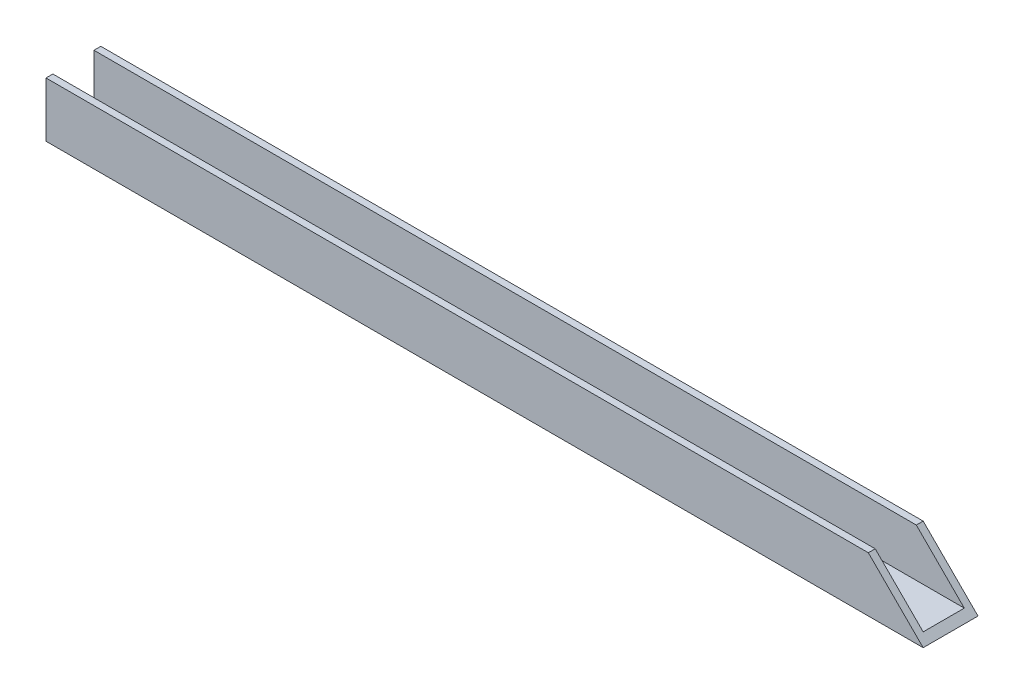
ISO-10303-21;
HEADER;
FILE_DESCRIPTION(('STEP AP214'),'2;1');
FILE_NAME('part.step','',(''),(''),'','','');
FILE_SCHEMA(('AUTOMOTIVE_DESIGN { 1 0 10303 214 1 1 1 1 }'));
ENDSEC;
DATA;
#1=APPLICATION_CONTEXT('core data for automotive mechanical design processes');
#2=APPLICATION_PROTOCOL_DEFINITION('international standard','automotive_design',2000,#1);
#3=PRODUCT_CONTEXT('',#1,'mechanical');
#4=PRODUCT('Part','Part','',(#3));
#5=PRODUCT_RELATED_PRODUCT_CATEGORY('part','',(#4));
#6=PRODUCT_DEFINITION_FORMATION('','',#4);
#7=PRODUCT_DEFINITION_CONTEXT('part definition',#1,'design');
#8=PRODUCT_DEFINITION('design','',#6,#7);
#9=PRODUCT_DEFINITION_SHAPE('','',#8);
#10=(LENGTH_UNIT() NAMED_UNIT(*) SI_UNIT(.MILLI.,.METRE.));
#11=(NAMED_UNIT(*) PLANE_ANGLE_UNIT() SI_UNIT($,.RADIAN.));
#12=(NAMED_UNIT(*) SI_UNIT($,.STERADIAN.) SOLID_ANGLE_UNIT());
#13=UNCERTAINTY_MEASURE_WITH_UNIT(LENGTH_MEASURE(1.E-05),#10,'distance_accuracy_value','');
#14=(GEOMETRIC_REPRESENTATION_CONTEXT(3) GLOBAL_UNCERTAINTY_ASSIGNED_CONTEXT((#13)) GLOBAL_UNIT_ASSIGNED_CONTEXT((#10,
#11,#12)) REPRESENTATION_CONTEXT('',''));
#15=CARTESIAN_POINT('',(0.,0.,0.));
#16=DIRECTION('',(0.,0.,1.));
#17=DIRECTION('',(1.,0.,0.));
#18=AXIS2_PLACEMENT_3D('',#15,#16,#17);
#19=CARTESIAN_POINT('',(406.4,22.225,9.525));
#20=DIRECTION('',(0.,0.,1.));
#21=DIRECTION('',(0.,-1.,0.));
#22=AXIS2_PLACEMENT_3D('',#19,#20,#21);
#23=PLANE('',#22);
#24=DIRECTION('',(-0.707106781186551,0.707106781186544,0.));
#25=VECTOR('',#24,1.);
#26=CARTESIAN_POINT('',(393.7,9.52499999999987,9.525));
#27=LINE('',#26,#25);
#28=CARTESIAN_POINT('',(403.225,0.,9.525));
#29=VERTEX_POINT('',#28);
#30=CARTESIAN_POINT('',(381.,22.225,9.52500000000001));
#31=VERTEX_POINT('',#30);
#32=EDGE_CURVE('E170',#29,#31,#27,.T.);
#33=ORIENTED_EDGE('',*,*,#32,.F.);
#34=DIRECTION('',(-1.,0.,0.));
#35=VECTOR('',#34,1.);
#36=CARTESIAN_POINT('',(406.4,0.,9.525));
#37=LINE('',#36,#35);
#38=CARTESIAN_POINT('',(0.,0.,9.525));
#39=VERTEX_POINT('',#38);
#40=EDGE_CURVE('E91',#29,#39,#37,.T.);
#41=ORIENTED_EDGE('',*,*,#40,.T.);
#42=DIRECTION('',(0.,1.,0.));
#43=VECTOR('',#42,1.);
#44=CARTESIAN_POINT('',(0.,22.225,9.525));
#45=LINE('',#44,#43);
#46=CARTESIAN_POINT('',(0.,22.225,9.525));
#47=VERTEX_POINT('',#46);
#48=EDGE_CURVE('E105',#39,#47,#45,.T.);
#49=ORIENTED_EDGE('',*,*,#48,.T.);
#50=DIRECTION('',(-1.,0.,0.));
#51=VECTOR('',#50,1.);
#52=CARTESIAN_POINT('',(406.4,22.225,9.525));
#53=LINE('',#52,#51);
#54=EDGE_CURVE('E13',#31,#47,#53,.T.);
#55=ORIENTED_EDGE('',*,*,#54,.F.);
#56=EDGE_LOOP('',(#33,#41,#49,#55));
#57=FACE_BOUND('',#56,.T.);
#58=ADVANCED_FACE('F34',(#57),#23,.F.);
#59=CARTESIAN_POINT('',(406.4,22.225,12.7));
#60=DIRECTION('',(0.,-1.,0.));
#61=DIRECTION('',(0.,0.,-1.));
#62=AXIS2_PLACEMENT_3D('',#59,#60,#61);
#63=PLANE('',#62);
#64=DIRECTION('',(0.,0.,1.));
#65=VECTOR('',#64,1.);
#66=CARTESIAN_POINT('',(381.,22.225,-1226.77090352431));
#67=LINE('',#66,#65);
#68=CARTESIAN_POINT('',(381.,22.225,12.7));
#69=VERTEX_POINT('',#68);
#70=EDGE_CURVE('E177',#31,#69,#67,.T.);
#71=ORIENTED_EDGE('',*,*,#70,.F.);
#72=ORIENTED_EDGE('',*,*,#54,.T.);
#73=DIRECTION('',(0.,0.,1.));
#74=VECTOR('',#73,1.);
#75=CARTESIAN_POINT('',(0.,22.225,12.7));
#76=LINE('',#75,#74);
#77=CARTESIAN_POINT('',(0.,22.225,12.7));
#78=VERTEX_POINT('',#77);
#79=EDGE_CURVE('E129',#47,#78,#76,.T.);
#80=ORIENTED_EDGE('',*,*,#79,.T.);
#81=DIRECTION('',(-1.,0.,0.));
#82=VECTOR('',#81,1.);
#83=CARTESIAN_POINT('',(406.4,22.225,12.7));
#84=LINE('',#83,#82);
#85=EDGE_CURVE('E42',#69,#78,#84,.T.);
#86=ORIENTED_EDGE('',*,*,#85,.F.);
#87=EDGE_LOOP('',(#71,#72,#80,#86));
#88=FACE_BOUND('',#87,.T.);
#89=ADVANCED_FACE('F130',(#88),#63,.F.);
#90=CARTESIAN_POINT('',(406.4,-3.175,12.7));
#91=DIRECTION('',(0.,0.,-1.));
#92=DIRECTION('',(-1.,0.,0.));
#93=AXIS2_PLACEMENT_3D('',#90,#91,#92);
#94=PLANE('',#93);
#95=DIRECTION('',(-0.707106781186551,0.707106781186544,0.));
#96=VECTOR('',#95,1.);
#97=CARTESIAN_POINT('',(406.4,-3.175,12.7));
#98=LINE('',#97,#96);
#99=CARTESIAN_POINT('',(406.4,-3.175,12.7));
#100=VERTEX_POINT('',#99);
#101=EDGE_CURVE('E49',#100,#69,#98,.T.);
#102=ORIENTED_EDGE('',*,*,#101,.T.);
#103=ORIENTED_EDGE('',*,*,#85,.T.);
#104=DIRECTION('',(0.,-1.,0.));
#105=VECTOR('',#104,1.);
#106=CARTESIAN_POINT('',(0.,-3.175,12.7));
#107=LINE('',#106,#105);
#108=CARTESIAN_POINT('',(0.,-3.175,12.7));
#109=VERTEX_POINT('',#108);
#110=EDGE_CURVE('E125',#78,#109,#107,.T.);
#111=ORIENTED_EDGE('',*,*,#110,.T.);
#112=DIRECTION('',(-1.,0.,0.));
#113=VECTOR('',#112,1.);
#114=CARTESIAN_POINT('',(406.4,-3.175,12.7));
#115=LINE('',#114,#113);
#116=EDGE_CURVE('E118',#100,#109,#115,.T.);
#117=ORIENTED_EDGE('',*,*,#116,.F.);
#118=EDGE_LOOP('',(#102,#103,#111,#117));
#119=FACE_BOUND('',#118,.T.);
#120=ADVANCED_FACE('F123',(#119),#94,.F.);
#121=CARTESIAN_POINT('',(406.4,22.225,-12.7));
#122=DIRECTION('',(0.,0.,1.));
#123=DIRECTION('',(1.,0.,0.));
#124=AXIS2_PLACEMENT_3D('',#121,#122,#123);
#125=PLANE('',#124);
#126=DIRECTION('',(-0.707106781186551,0.707106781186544,0.));
#127=VECTOR('',#126,1.);
#128=CARTESIAN_POINT('',(393.7,9.52499999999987,-12.7));
#129=LINE('',#128,#127);
#130=CARTESIAN_POINT('',(406.4,-3.175,-12.6999999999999));
#131=VERTEX_POINT('',#130);
#132=CARTESIAN_POINT('',(381.,22.225,-12.6999999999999));
#133=VERTEX_POINT('',#132);
#134=EDGE_CURVE('E154',#131,#133,#129,.T.);
#135=ORIENTED_EDGE('',*,*,#134,.F.);
#136=DIRECTION('',(-1.,0.,0.));
#137=VECTOR('',#136,1.);
#138=CARTESIAN_POINT('',(406.4,-3.175,-12.7));
#139=LINE('',#138,#137);
#140=CARTESIAN_POINT('',(0.,-3.175,-12.7));
#141=VERTEX_POINT('',#140);
#142=EDGE_CURVE('E115',#131,#141,#139,.T.);
#143=ORIENTED_EDGE('',*,*,#142,.T.);
#144=DIRECTION('',(0.,1.,0.));
#145=VECTOR('',#144,1.);
#146=CARTESIAN_POINT('',(0.,22.225,-12.7));
#147=LINE('',#146,#145);
#148=CARTESIAN_POINT('',(0.,22.225,-12.7));
#149=VERTEX_POINT('',#148);
#150=EDGE_CURVE('E137',#141,#149,#147,.T.);
#151=ORIENTED_EDGE('',*,*,#150,.T.);
#152=DIRECTION('',(-1.,0.,0.));
#153=VECTOR('',#152,1.);
#154=CARTESIAN_POINT('',(406.4,22.225,-12.7));
#155=LINE('',#154,#153);
#156=EDGE_CURVE('E113',#133,#149,#155,.T.);
#157=ORIENTED_EDGE('',*,*,#156,.F.);
#158=EDGE_LOOP('',(#135,#143,#151,#157));
#159=FACE_BOUND('',#158,.T.);
#160=ADVANCED_FACE('F149',(#159),#125,.F.);
#161=CARTESIAN_POINT('',(406.4,22.225,-9.52499999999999));
#162=DIRECTION('',(0.,-1.,0.));
#163=DIRECTION('',(0.,0.,-1.));
#164=AXIS2_PLACEMENT_3D('',#161,#162,#163);
#165=PLANE('',#164);
#166=CARTESIAN_POINT('',(381.,22.225,-9.52500000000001));
#167=VERTEX_POINT('',#166);
#168=EDGE_CURVE('E179',#133,#167,#67,.T.);
#169=ORIENTED_EDGE('',*,*,#168,.F.);
#170=ORIENTED_EDGE('',*,*,#156,.T.);
#171=DIRECTION('',(0.,0.,1.));
#172=VECTOR('',#171,1.);
#173=CARTESIAN_POINT('',(0.,22.225,-9.52499999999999));
#174=LINE('',#173,#172);
#175=CARTESIAN_POINT('',(0.,22.225,-9.52499999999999));
#176=VERTEX_POINT('',#175);
#177=EDGE_CURVE('E100',#149,#176,#174,.T.);
#178=ORIENTED_EDGE('',*,*,#177,.T.);
#179=DIRECTION('',(-1.,0.,0.));
#180=VECTOR('',#179,1.);
#181=CARTESIAN_POINT('',(406.4,22.225,-9.52499999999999));
#182=LINE('',#181,#180);
#183=EDGE_CURVE('E90',#167,#176,#182,.T.);
#184=ORIENTED_EDGE('',*,*,#183,.F.);
#185=EDGE_LOOP('',(#169,#170,#178,#184));
#186=FACE_BOUND('',#185,.T.);
#187=ADVANCED_FACE('F144',(#186),#165,.F.);
#188=CARTESIAN_POINT('',(406.4,0.,-9.525));
#189=DIRECTION('',(0.,0.,-1.));
#190=DIRECTION('',(0.,1.,0.));
#191=AXIS2_PLACEMENT_3D('',#188,#189,#190);
#192=PLANE('',#191);
#193=DIRECTION('',(0.707106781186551,-0.707106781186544,0.));
#194=VECTOR('',#193,1.);
#195=CARTESIAN_POINT('',(404.8125,-1.58750000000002,-9.525));
#196=LINE('',#195,#194);
#197=CARTESIAN_POINT('',(403.225,0.,-9.525));
#198=VERTEX_POINT('',#197);
#199=EDGE_CURVE('E167',#167,#198,#196,.T.);
#200=ORIENTED_EDGE('',*,*,#199,.F.);
#201=ORIENTED_EDGE('',*,*,#183,.T.);
#202=DIRECTION('',(0.,-1.,0.));
#203=VECTOR('',#202,1.);
#204=CARTESIAN_POINT('',(0.,0.,-9.525));
#205=LINE('',#204,#203);
#206=CARTESIAN_POINT('',(0.,0.,-9.525));
#207=VERTEX_POINT('',#206);
#208=EDGE_CURVE('E94',#176,#207,#205,.T.);
#209=ORIENTED_EDGE('',*,*,#208,.T.);
#210=DIRECTION('',(-1.,0.,0.));
#211=VECTOR('',#210,1.);
#212=CARTESIAN_POINT('',(406.4,0.,-9.525));
#213=LINE('',#212,#211);
#214=EDGE_CURVE('E78',#198,#207,#213,.T.);
#215=ORIENTED_EDGE('',*,*,#214,.F.);
#216=EDGE_LOOP('',(#200,#201,#209,#215));
#217=FACE_BOUND('',#216,.T.);
#218=ADVANCED_FACE('F95',(#217),#192,.F.);
#219=CARTESIAN_POINT('',(406.4,0.,9.525));
#220=DIRECTION('',(0.,-1.,0.));
#221=DIRECTION('',(0.,0.,-1.));
#222=AXIS2_PLACEMENT_3D('',#219,#220,#221);
#223=PLANE('',#222);
#224=DIRECTION('',(0.,0.,1.));
#225=VECTOR('',#224,1.);
#226=CARTESIAN_POINT('',(403.225,0.,9.525));
#227=LINE('',#226,#225);
#228=EDGE_CURVE('E87',#198,#29,#227,.T.);
#229=ORIENTED_EDGE('',*,*,#228,.F.);
#230=ORIENTED_EDGE('',*,*,#214,.T.);
#231=DIRECTION('',(0.,0.,1.));
#232=VECTOR('',#231,1.);
#233=CARTESIAN_POINT('',(0.,0.,9.525));
#234=LINE('',#233,#232);
#235=EDGE_CURVE('E83',#207,#39,#234,.T.);
#236=ORIENTED_EDGE('',*,*,#235,.T.);
#237=ORIENTED_EDGE('',*,*,#40,.F.);
#238=EDGE_LOOP('',(#229,#230,#236,#237));
#239=FACE_BOUND('',#238,.T.);
#240=ADVANCED_FACE('F80',(#239),#223,.F.);
#241=CARTESIAN_POINT('',(406.4,-3.175,-12.7));
#242=DIRECTION('',(0.,1.,0.));
#243=DIRECTION('',(0.,0.,1.));
#244=AXIS2_PLACEMENT_3D('',#241,#242,#243);
#245=PLANE('',#244);
#246=DIRECTION('',(0.,0.,-1.));
#247=VECTOR('',#246,1.);
#248=CARTESIAN_POINT('',(0.,-3.175,-12.7));
#249=LINE('',#248,#247);
#250=EDGE_CURVE('E135',#109,#141,#249,.T.);
#251=ORIENTED_EDGE('',*,*,#250,.T.);
#252=ORIENTED_EDGE('',*,*,#142,.F.);
#253=DIRECTION('',(0.,0.,-1.));
#254=VECTOR('',#253,1.);
#255=CARTESIAN_POINT('',(406.4,-3.175,-12.7));
#256=LINE('',#255,#254);
#257=EDGE_CURVE('E106',#100,#131,#256,.T.);
#258=ORIENTED_EDGE('',*,*,#257,.F.);
#259=ORIENTED_EDGE('',*,*,#116,.T.);
#260=EDGE_LOOP('',(#251,#252,#258,#259));
#261=FACE_BOUND('',#260,.T.);
#262=ADVANCED_FACE('F157',(#261),#245,.F.);
#263=CARTESIAN_POINT('',(0.,0.,9.525));
#264=DIRECTION('',(1.,0.,0.));
#265=DIRECTION('',(0.,0.,-1.));
#266=AXIS2_PLACEMENT_3D('',#263,#264,#265);
#267=PLANE('',#266);
#268=ORIENTED_EDGE('',*,*,#48,.F.);
#269=ORIENTED_EDGE('',*,*,#235,.F.);
#270=ORIENTED_EDGE('',*,*,#208,.F.);
#271=ORIENTED_EDGE('',*,*,#177,.F.);
#272=ORIENTED_EDGE('',*,*,#150,.F.);
#273=ORIENTED_EDGE('',*,*,#250,.F.);
#274=ORIENTED_EDGE('',*,*,#110,.F.);
#275=ORIENTED_EDGE('',*,*,#79,.F.);
#276=EDGE_LOOP('',(#268,#269,#270,#271,#272,#273,#274,#275));
#277=FACE_BOUND('',#276,.T.);
#278=ADVANCED_FACE('F102',(#277),#267,.F.);
#279=CARTESIAN_POINT('',(406.4,-3.175,-1226.77090352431));
#280=DIRECTION('',(0.707106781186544,0.707106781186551,0.));
#281=DIRECTION('',(-0.707106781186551,0.707106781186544,0.));
#282=AXIS2_PLACEMENT_3D('',#279,#280,#281);
#283=PLANE('',#282);
#284=ORIENTED_EDGE('',*,*,#134,.T.);
#285=ORIENTED_EDGE('',*,*,#168,.T.);
#286=ORIENTED_EDGE('',*,*,#199,.T.);
#287=ORIENTED_EDGE('',*,*,#228,.T.);
#288=ORIENTED_EDGE('',*,*,#32,.T.);
#289=ORIENTED_EDGE('',*,*,#70,.T.);
#290=ORIENTED_EDGE('',*,*,#101,.F.);
#291=ORIENTED_EDGE('',*,*,#257,.T.);
#292=EDGE_LOOP('',(#284,#285,#286,#287,#288,#289,#290,#291));
#293=FACE_BOUND('',#292,.T.);
#294=ADVANCED_FACE('F169',(#293),#283,.T.);
#295=CLOSED_SHELL('',(#58,#89,#120,#160,#187,#218,#240,#262,#278,#294));
#296=MANIFOLD_SOLID_BREP('B2',#295);
#297=ADVANCED_BREP_SHAPE_REPRESENTATION('',(#18,#296),#14);
#298=SHAPE_DEFINITION_REPRESENTATION(#9,#297);
ENDSEC;
END-ISO-10303-21;
